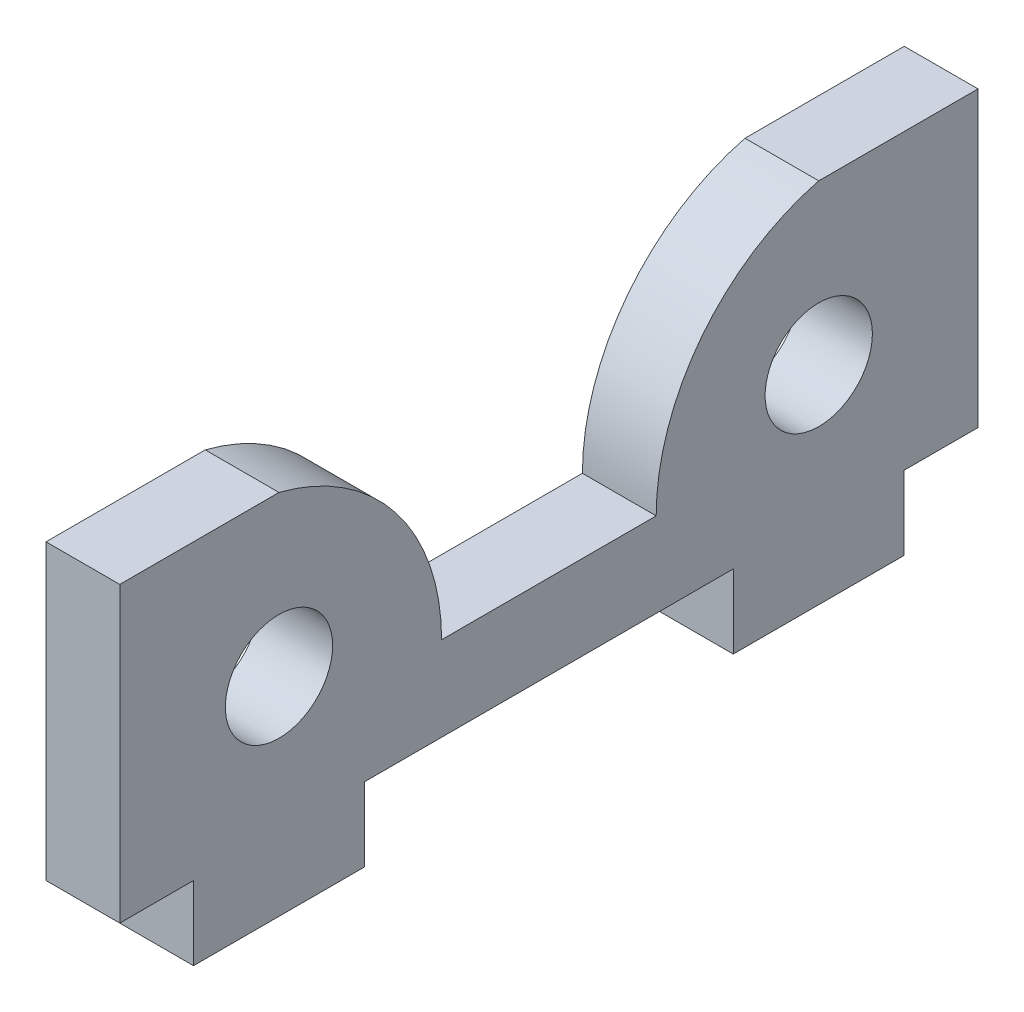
from build123d import *

# Parameters (mm, degrees)
SKETCH1_R           = 4
BOSS_EXTRUDE6_DEPTH = 5.5


with BuildPart() as part:
    # Sketch1 → Boss-Extrude6 (new body)
    with BuildSketch(Plane(origin=(0, 0, 0), x_dir=(0, 0, -1), z_dir=(1, 0, 0))):
        with BuildLine():
            ThreePointArc((-18.5, 11.8), (-15.111385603, 21.669096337), (-6.375, 27.375))
            Line((-6.375, 27.375), (5.5, 27.375))
            Line((5.5, 27.375), (5.5, 5.5))
            Line((5.5, 5.5), (0, 5.5))
            Line((0, 5.5), (0, 0))
            Line((0, 0), (-12.75, 0))
            Line((-12.75, 0), (-12.75, 5.5))
            Line((-12.75, 5.5), (-40.25, 5.5))
            Line((-40.25, 5.5), (-40.25, 0))
            Line((-40.25, 0), (-53, 0))
            Line((-53, 0), (-53, 5.5))
            Line((-53, 5.5), (-58.5, 5.5))
            Line((-58.5, 5.5), (-58.5, 27.375))
            Line((-58.5, 27.375), (-46.625, 27.375))
            ThreePointArc((-46.625, 27.375), (-37.888614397, 21.669096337), (-34.5, 11.8))
            Line((-34.5, 11.8), (-18.5, 11.8))
        make_face()
        with Locations((-6.375, 15.5)):
            Circle(SKETCH1_R, mode=Mode.SUBTRACT)
        with Locations((-46.625, 15.5)):
            Circle(SKETCH1_R, mode=Mode.SUBTRACT)
    extrude(amount=BOSS_EXTRUDE6_DEPTH)


solid = part.part
